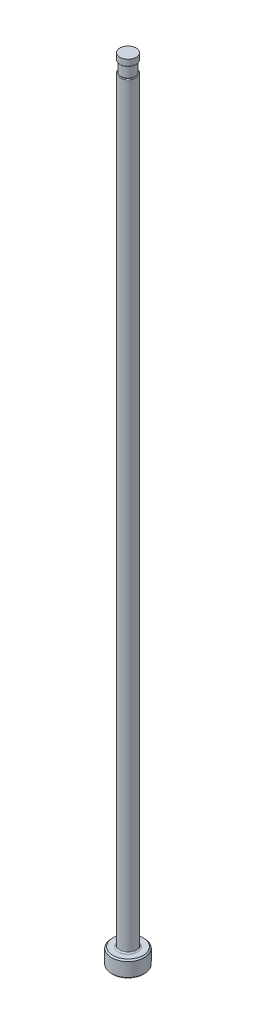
ISO-10303-21;
HEADER;
FILE_DESCRIPTION(('STEP AP214'),'2;1');
FILE_NAME('part.step','',(''),(''),'','','');
FILE_SCHEMA(('AUTOMOTIVE_DESIGN { 1 0 10303 214 1 1 1 1 }'));
ENDSEC;
DATA;
#1=APPLICATION_CONTEXT('core data for automotive mechanical design processes');
#2=APPLICATION_PROTOCOL_DEFINITION('international standard','automotive_design',2000,#1);
#3=PRODUCT_CONTEXT('',#1,'mechanical');
#4=PRODUCT('Part','Part','',(#3));
#5=PRODUCT_RELATED_PRODUCT_CATEGORY('part','',(#4));
#6=PRODUCT_DEFINITION_FORMATION('','',#4);
#7=PRODUCT_DEFINITION_CONTEXT('part definition',#1,'design');
#8=PRODUCT_DEFINITION('design','',#6,#7);
#9=PRODUCT_DEFINITION_SHAPE('','',#8);
#10=(LENGTH_UNIT() NAMED_UNIT(*) SI_UNIT(.MILLI.,.METRE.));
#11=(NAMED_UNIT(*) PLANE_ANGLE_UNIT() SI_UNIT($,.RADIAN.));
#12=(NAMED_UNIT(*) SI_UNIT($,.STERADIAN.) SOLID_ANGLE_UNIT());
#13=UNCERTAINTY_MEASURE_WITH_UNIT(LENGTH_MEASURE(1.E-05),#10,'distance_accuracy_value','');
#14=(GEOMETRIC_REPRESENTATION_CONTEXT(3) GLOBAL_UNCERTAINTY_ASSIGNED_CONTEXT((#13)) GLOBAL_UNIT_ASSIGNED_CONTEXT((#10,
#11,#12)) REPRESENTATION_CONTEXT('',''));
#15=CARTESIAN_POINT('',(0.,0.,0.));
#16=DIRECTION('',(0.,0.,1.));
#17=DIRECTION('',(1.,0.,0.));
#18=AXIS2_PLACEMENT_3D('',#15,#16,#17);
#19=CARTESIAN_POINT('',(-1.58749999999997,151.13,0.));
#20=DIRECTION('',(0.,1.,0.));
#21=DIRECTION('',(0.,0.,1.));
#22=AXIS2_PLACEMENT_3D('',#19,#20,#21);
#23=PLANE('',#22);
#24=CARTESIAN_POINT('',(0.,151.13,0.));
#25=DIRECTION('',(0.,1.,0.));
#26=DIRECTION('',(0.,0.,1.));
#27=AXIS2_PLACEMENT_3D('',#24,#25,#26);
#28=CIRCLE('',#27,1.44144999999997);
#29=CARTESIAN_POINT('',(0.,151.13,1.44144999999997));
#30=VERTEX_POINT('',#29);
#31=EDGE_CURVE('E11',#30,#30,#28,.F.);
#32=ORIENTED_EDGE('',*,*,#31,.T.);
#33=EDGE_LOOP('',(#32));
#34=FACE_BOUND('',#33,.T.);
#35=CARTESIAN_POINT('',(0.,151.13,0.));
#36=DIRECTION('',(0.,1.,0.));
#37=DIRECTION('',(0.,0.,1.));
#38=AXIS2_PLACEMENT_3D('',#35,#36,#37);
#39=CIRCLE('',#38,1.38429999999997);
#40=CARTESIAN_POINT('',(0.,151.13,1.38429999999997));
#41=VERTEX_POINT('',#40);
#42=EDGE_CURVE('E78',#41,#41,#39,.T.);
#43=ORIENTED_EDGE('',*,*,#42,.T.);
#44=EDGE_LOOP('',(#43));
#45=FACE_BOUND('',#44,.T.);
#46=ADVANCED_FACE('F36',(#34,#45),#23,.F.);
#47=CARTESIAN_POINT('',(0.,259.958771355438,0.));
#48=DIRECTION('',(0.,1.,0.));
#49=DIRECTION('',(0.,0.,1.));
#50=AXIS2_PLACEMENT_3D('',#47,#48,#49);
#51=CYLINDRICAL_SURFACE('',#50,1.58749999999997);
#52=DIRECTION('',(0.,1.,0.));
#53=VECTOR('',#52,1.);
#54=CARTESIAN_POINT('',(-1.38429999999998,259.958771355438,-0.777090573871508));
#55=LINE('',#54,#53);
#56=CARTESIAN_POINT('',(-1.38429999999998,148.971,-0.777090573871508));
#57=VERTEX_POINT('',#56);
#58=CARTESIAN_POINT('',(-1.38429999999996,86.614,-0.777090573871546));
#59=VERTEX_POINT('',#58);
#60=EDGE_CURVE('E73',#57,#59,#55,.F.);
#61=ORIENTED_EDGE('',*,*,#60,.F.);
#62=CARTESIAN_POINT('',(0.,148.971,0.));
#63=DIRECTION('',(0.,-1.,0.));
#64=DIRECTION('',(0.,0.,-1.));
#65=AXIS2_PLACEMENT_3D('',#62,#63,#64);
#66=CIRCLE('',#65,1.58749999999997);
#67=CARTESIAN_POINT('',(-1.38429999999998,148.971,0.777090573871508));
#68=VERTEX_POINT('',#67);
#69=EDGE_CURVE('E51',#57,#68,#66,.T.);
#70=ORIENTED_EDGE('',*,*,#69,.T.);
#71=DIRECTION('',(0.,1.,0.));
#72=VECTOR('',#71,1.);
#73=CARTESIAN_POINT('',(-1.38429999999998,259.958771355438,0.777090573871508));
#74=LINE('',#73,#72);
#75=CARTESIAN_POINT('',(-1.38429999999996,86.614,0.777090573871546));
#76=VERTEX_POINT('',#75);
#77=EDGE_CURVE('E84',#76,#68,#74,.T.);
#78=ORIENTED_EDGE('',*,*,#77,.F.);
#79=CARTESIAN_POINT('',(-1.38429999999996,86.614,-0.777090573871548));
#80=CARTESIAN_POINT('',(-1.38429609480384,86.5767272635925,-0.777082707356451));
#81=CARTESIAN_POINT('',(-1.38495631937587,86.5394527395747,-0.775921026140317));
#82=CARTESIAN_POINT('',(-1.38757712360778,86.4650763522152,-0.771232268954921));
#83=CARTESIAN_POINT('',(-1.38953849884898,86.4279746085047,-0.767703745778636));
#84=CARTESIAN_POINT('',(-1.39477495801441,86.3535790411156,-0.758148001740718));
#85=CARTESIAN_POINT('',(-1.39807044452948,86.316291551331,-0.752081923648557));
#86=CARTESIAN_POINT('',(-1.40590319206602,86.2423849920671,-0.737333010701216));
#87=CARTESIAN_POINT('',(-1.41044024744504,86.2057658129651,-0.728650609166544));
#88=CARTESIAN_POINT('',(-1.42582382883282,86.096986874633,-0.698367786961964));
#89=CARTESIAN_POINT('',(-1.43842338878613,86.0261687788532,-0.672562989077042));
#90=CARTESIAN_POINT('',(-1.46680838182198,85.8916572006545,-0.608160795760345));
#91=CARTESIAN_POINT('',(-1.48256997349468,85.8279156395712,-0.569657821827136));
#92=CARTESIAN_POINT('',(-1.50737283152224,85.7379333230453,-0.498685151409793));
#93=CARTESIAN_POINT('',(-1.51626333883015,85.7076802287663,-0.471232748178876));
#94=CARTESIAN_POINT('',(-1.53347485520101,85.6517865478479,-0.411785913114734));
#95=CARTESIAN_POINT('',(-1.54179640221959,85.6261415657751,-0.379795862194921));
#96=CARTESIAN_POINT('',(-1.55583338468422,85.5843277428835,-0.316871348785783));
#97=CARTESIAN_POINT('',(-1.56175286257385,85.5673042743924,-0.28655344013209));
#98=CARTESIAN_POINT('',(-1.57203785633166,85.53830135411,-0.223329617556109));
#99=CARTESIAN_POINT('',(-1.57640406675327,85.5263196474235,-0.190424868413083));
#100=CARTESIAN_POINT('',(-1.58312350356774,85.5080632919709,-0.122641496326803));
#101=CARTESIAN_POINT('',(-1.58546485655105,85.5018222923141,-0.0877524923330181));
#102=CARTESIAN_POINT('',(-1.58779523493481,85.4956097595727,-0.0173445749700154));
#103=CARTESIAN_POINT('',(-1.58778524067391,85.4956356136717,0.0181740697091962));
#104=CARTESIAN_POINT('',(-1.58553927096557,85.5016246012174,0.0850166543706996));
#105=CARTESIAN_POINT('',(-1.58352667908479,85.5069919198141,0.116403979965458));
#106=CARTESIAN_POINT('',(-1.57781194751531,85.5224774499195,0.177812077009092));
#107=CARTESIAN_POINT('',(-1.57410971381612,85.5325959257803,0.20783277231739));
#108=CARTESIAN_POINT('',(-1.56522233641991,85.5574483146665,0.266740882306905));
#109=CARTESIAN_POINT('',(-1.55999564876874,85.5723128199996,0.295566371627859));
#110=CARTESIAN_POINT('',(-1.54854541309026,85.6058843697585,0.350651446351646));
#111=CARTESIAN_POINT('',(-1.54232137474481,85.6245933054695,0.376909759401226));
#112=CARTESIAN_POINT('',(-1.52624085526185,85.674770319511,0.438380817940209));
#113=CARTESIAN_POINT('',(-1.51605337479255,85.7080994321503,0.471992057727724));
#114=CARTESIAN_POINT('',(-1.49561074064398,85.7798332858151,0.533246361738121));
#115=CARTESIAN_POINT('',(-1.48535548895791,85.8182487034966,0.560876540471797));
#116=CARTESIAN_POINT('',(-1.46194815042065,85.9138127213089,0.61985698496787));
#117=CARTESIAN_POINT('',(-1.44915247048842,85.9725828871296,0.648714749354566));
#118=CARTESIAN_POINT('',(-1.42648713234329,86.0944065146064,0.697138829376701));
#119=CARTESIAN_POINT('',(-1.41662511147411,86.1574706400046,0.716680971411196));
#120=CARTESIAN_POINT('',(-1.40064446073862,86.2858415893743,0.747428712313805));
#121=CARTESIAN_POINT('',(-1.39451475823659,86.3511411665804,0.758658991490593));
#122=CARTESIAN_POINT('',(-1.38838804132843,86.449622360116,0.769772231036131));
#123=CARTESIAN_POINT('',(-1.38685717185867,86.4824222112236,0.772521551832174));
#124=CARTESIAN_POINT('',(-1.38481284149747,86.5481449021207,0.776178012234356));
#125=CARTESIAN_POINT('',(-1.38429902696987,86.5810676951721,0.777085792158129));
#126=CARTESIAN_POINT('',(-1.38429999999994,86.6139999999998,0.777090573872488));
#127=B_SPLINE_CURVE_WITH_KNOTS('',3,(#79,#80,#81,#82,#83,#84,#85,#86,#87,#88,#89,#90,#91,#92,
#93,#94,#95,#96,#97,#98,#99,#100,#101,#102,#103,#104,#105,#106,#107,#108,#109,#110,#111,#112,
#113,#114,#115,#116,#117,#118,#119,#120,#121,#122,#123,#124,#125,#126),.UNSPECIFIED.,.F.,.F.,(4,
2,2,2,2,2,2,2,2,2,2,2,2,2,2,2,2,2,2,2,2,2,2,4),(0.,0.111796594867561,0.22366161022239,
0.33730621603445,0.450932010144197,0.678971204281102,0.905351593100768,1.03037322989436,
1.1552749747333,1.26065408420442,1.36598601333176,1.47193148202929,1.57783277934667,
1.67311136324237,1.76839524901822,1.86656705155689,1.96478726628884,2.10923104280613,
2.25398297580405,2.45303424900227,2.65259927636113,2.85156933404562,2.95036438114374,
3.04912507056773),.UNSPECIFIED.);
#128=EDGE_CURVE('E81',#59,#76,#127,.T.);
#129=ORIENTED_EDGE('',*,*,#128,.F.);
#130=EDGE_LOOP('',(#61,#70,#78,#129));
#131=FACE_BOUND('',#130,.T.);
#132=CARTESIAN_POINT('',(0.,3.42900000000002,0.));
#133=DIRECTION('',(0.,1.,0.));
#134=DIRECTION('',(0.,0.,1.));
#135=AXIS2_PLACEMENT_3D('',#132,#133,#134);
#136=CIRCLE('',#135,1.58749999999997);
#137=CARTESIAN_POINT('',(0.,3.42900000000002,1.58749999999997));
#138=VERTEX_POINT('',#137);
#139=EDGE_CURVE('E116',#138,#138,#136,.T.);
#140=ORIENTED_EDGE('',*,*,#139,.T.);
#141=EDGE_LOOP('',(#140));
#142=FACE_BOUND('',#141,.T.);
#143=ADVANCED_FACE('F82',(#131,#142),#51,.T.);
#144=CARTESIAN_POINT('',(0.,0.,0.));
#145=DIRECTION('',(0.,-1.,0.));
#146=DIRECTION('',(0.,0.,-1.));
#147=AXIS2_PLACEMENT_3D('',#144,#145,#146);
#148=PLANE('',#147);
#149=CARTESIAN_POINT('',(0.,0.,0.));
#150=DIRECTION('',(0.,-1.,0.));
#151=DIRECTION('',(0.,0.,-1.));
#152=AXIS2_PLACEMENT_3D('',#149,#150,#151);
#153=CIRCLE('',#152,2.92099999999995);
#154=CARTESIAN_POINT('',(0.,0.,-2.92099999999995));
#155=VERTEX_POINT('',#154);
#156=EDGE_CURVE('E113',#155,#155,#153,.T.);
#157=ORIENTED_EDGE('',*,*,#156,.T.);
#158=EDGE_LOOP('',(#157));
#159=FACE_BOUND('',#158,.T.);
#160=ADVANCED_FACE('F192',(#159),#148,.T.);
#161=CARTESIAN_POINT('',(0.,259.958771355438,0.));
#162=DIRECTION('',(0.,1.,0.));
#163=DIRECTION('',(0.,0.,1.));
#164=AXIS2_PLACEMENT_3D('',#161,#162,#163);
#165=CYLINDRICAL_SURFACE('',#164,3.17499999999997);
#166=CARTESIAN_POINT('',(0.,2.92100000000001,0.));
#167=DIRECTION('',(0.,1.,0.));
#168=DIRECTION('',(0.,0.,1.));
#169=AXIS2_PLACEMENT_3D('',#166,#167,#168);
#170=CIRCLE('',#169,3.17499999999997);
#171=CARTESIAN_POINT('',(0.,2.92100000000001,3.17499999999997));
#172=VERTEX_POINT('',#171);
#173=EDGE_CURVE('E110',#172,#172,#170,.F.);
#174=ORIENTED_EDGE('',*,*,#173,.T.);
#175=EDGE_LOOP('',(#174));
#176=FACE_BOUND('',#175,.T.);
#177=CARTESIAN_POINT('',(0.,0.254000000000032,0.));
#178=DIRECTION('',(0.,-1.,0.));
#179=DIRECTION('',(0.,0.,-1.));
#180=AXIS2_PLACEMENT_3D('',#177,#178,#179);
#181=CIRCLE('',#180,3.17499999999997);
#182=CARTESIAN_POINT('',(0.,0.254000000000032,-3.17499999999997));
#183=VERTEX_POINT('',#182);
#184=EDGE_CURVE('E107',#183,#183,#181,.F.);
#185=ORIENTED_EDGE('',*,*,#184,.T.);
#186=EDGE_LOOP('',(#185));
#187=FACE_BOUND('',#186,.T.);
#188=ADVANCED_FACE('F195',(#176,#187),#165,.T.);
#189=CARTESIAN_POINT('',(-3.17499999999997,3.175,0.));
#190=DIRECTION('',(0.,1.,0.));
#191=DIRECTION('',(0.,0.,1.));
#192=AXIS2_PLACEMENT_3D('',#189,#190,#191);
#193=PLANE('',#192);
#194=CARTESIAN_POINT('',(0.,3.175,0.));
#195=DIRECTION('',(0.,1.,0.));
#196=DIRECTION('',(0.,0.,1.));
#197=AXIS2_PLACEMENT_3D('',#194,#195,#196);
#198=CIRCLE('',#197,1.84149999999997);
#199=CARTESIAN_POINT('',(0.,3.175,1.84149999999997));
#200=VERTEX_POINT('',#199);
#201=EDGE_CURVE('E87',#200,#200,#198,.F.);
#202=ORIENTED_EDGE('',*,*,#201,.T.);
#203=EDGE_LOOP('',(#202));
#204=FACE_BOUND('',#203,.T.);
#205=CARTESIAN_POINT('',(0.,3.175,0.));
#206=DIRECTION('',(0.,1.,0.));
#207=DIRECTION('',(0.,0.,1.));
#208=AXIS2_PLACEMENT_3D('',#205,#206,#207);
#209=CIRCLE('',#208,2.92099999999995);
#210=CARTESIAN_POINT('',(0.,3.175,2.92099999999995));
#211=VERTEX_POINT('',#210);
#212=EDGE_CURVE('E104',#211,#211,#209,.T.);
#213=ORIENTED_EDGE('',*,*,#212,.T.);
#214=EDGE_LOOP('',(#213));
#215=FACE_BOUND('',#214,.T.);
#216=ADVANCED_FACE('F190',(#204,#215),#193,.T.);
#217=CARTESIAN_POINT('',(0.,3.17499999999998,0.));
#218=DIRECTION('',(0.,-1.,0.));
#219=DIRECTION('',(0.,0.,-1.));
#220=AXIS2_PLACEMENT_3D('',#217,#218,#219);
#221=CONICAL_SURFACE('',#220,2.92099999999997,0.7853981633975);
#222=ORIENTED_EDGE('',*,*,#173,.F.);
#223=EDGE_LOOP('',(#222));
#224=FACE_BOUND('',#223,.T.);
#225=ORIENTED_EDGE('',*,*,#212,.F.);
#226=EDGE_LOOP('',(#225));
#227=FACE_BOUND('',#226,.T.);
#228=ADVANCED_FACE('F186',(#224,#227),#221,.T.);
#229=CARTESIAN_POINT('',(0.,0.254000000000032,0.));
#230=DIRECTION('',(0.,1.,0.));
#231=DIRECTION('',(0.,0.,1.));
#232=AXIS2_PLACEMENT_3D('',#229,#230,#231);
#233=CONICAL_SURFACE('',#232,3.17499999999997,0.785398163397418);
#234=ORIENTED_EDGE('',*,*,#156,.F.);
#235=EDGE_LOOP('',(#234));
#236=FACE_BOUND('',#235,.T.);
#237=ORIENTED_EDGE('',*,*,#184,.F.);
#238=EDGE_LOOP('',(#237));
#239=FACE_BOUND('',#238,.T.);
#240=ADVANCED_FACE('F182',(#236,#239),#233,.T.);
#241=CARTESIAN_POINT('',(0.,3.42900000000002,0.));
#242=DIRECTION('',(0.,1.,0.));
#243=DIRECTION('',(0.,0.,1.));
#244=AXIS2_PLACEMENT_3D('',#241,#242,#243);
#245=TOROIDAL_SURFACE('',#244,1.84149999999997,0.254);
#246=ORIENTED_EDGE('',*,*,#201,.F.);
#247=EDGE_LOOP('',(#246));
#248=FACE_BOUND('',#247,.T.);
#249=ORIENTED_EDGE('',*,*,#139,.F.);
#250=EDGE_LOOP('',(#249));
#251=FACE_BOUND('',#250,.T.);
#252=ADVANCED_FACE('F147',(#248,#251),#245,.F.);
#253=CARTESIAN_POINT('',(-1.58749999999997,149.098,0.));
#254=DIRECTION('',(0.,-1.,0.));
#255=DIRECTION('',(0.,0.,-1.));
#256=AXIS2_PLACEMENT_3D('',#253,#254,#255);
#257=PLANE('',#256);
#258=DIRECTION('',(0.,0.,1.));
#259=VECTOR('',#258,1.);
#260=CARTESIAN_POINT('',(-1.38429999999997,149.098,0.));
#261=LINE('',#260,#259);
#262=CARTESIAN_POINT('',(-1.38429999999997,149.098,0.));
#263=VERTEX_POINT('',#262);
#264=CARTESIAN_POINT('',(-1.38429999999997,149.098,0.465589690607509));
#265=VERTEX_POINT('',#264);
#266=EDGE_CURVE('E90',#263,#265,#261,.T.);
#267=ORIENTED_EDGE('',*,*,#266,.T.);
#268=CARTESIAN_POINT('',(0.,149.098,0.));
#269=DIRECTION('',(0.,-1.,0.));
#270=DIRECTION('',(0.,0.,-1.));
#271=AXIS2_PLACEMENT_3D('',#268,#269,#270);
#272=CIRCLE('',#271,1.46049999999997);
#273=CARTESIAN_POINT('',(-1.38429999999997,149.098,-0.465589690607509));
#274=VERTEX_POINT('',#273);
#275=EDGE_CURVE('E86',#265,#274,#272,.F.);
#276=ORIENTED_EDGE('',*,*,#275,.T.);
#277=EDGE_CURVE('E79',#274,#263,#261,.T.);
#278=ORIENTED_EDGE('',*,*,#277,.T.);
#279=CARTESIAN_POINT('',(0.,149.098,0.));
#280=DIRECTION('',(0.,1.,0.));
#281=DIRECTION('',(0.,0.,1.));
#282=AXIS2_PLACEMENT_3D('',#279,#280,#281);
#283=CIRCLE('',#282,1.38429999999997);
#284=EDGE_CURVE('E101',#263,#263,#283,.T.);
#285=ORIENTED_EDGE('',*,*,#284,.F.);
#286=EDGE_LOOP('',(#267,#276,#278,#285));
#287=FACE_BOUND('',#286,.T.);
#288=ADVANCED_FACE('F144',(#287),#257,.F.);
#289=CARTESIAN_POINT('',(0.,153.448281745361,0.));
#290=DIRECTION('',(0.,1.,0.));
#291=DIRECTION('',(0.,0.,1.));
#292=AXIS2_PLACEMENT_3D('',#289,#290,#291);
#293=CYLINDRICAL_SURFACE('',#292,1.38429999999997);
#294=ORIENTED_EDGE('',*,*,#42,.F.);
#295=EDGE_LOOP('',(#294));
#296=FACE_BOUND('',#295,.T.);
#297=ORIENTED_EDGE('',*,*,#284,.T.);
#298=EDGE_LOOP('',(#297));
#299=FACE_BOUND('',#298,.T.);
#300=ADVANCED_FACE('F141',(#296,#299),#293,.T.);
#301=CARTESIAN_POINT('',(-1.38429999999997,150.114,-3.17499999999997));
#302=DIRECTION('',(1.,0.,0.));
#303=DIRECTION('',(0.,1.,0.));
#304=AXIS2_PLACEMENT_3D('',#301,#302,#303);
#305=PLANE('',#304);
#306=ORIENTED_EDGE('',*,*,#277,.F.);
#307=CARTESIAN_POINT('',(-1.38429999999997,149.098,-0.465589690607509));
#308=CARTESIAN_POINT('',(-1.38429999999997,149.097994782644,-0.479559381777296));
#309=CARTESIAN_POINT('',(-1.38429999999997,149.097765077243,-0.493535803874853));
#310=CARTESIAN_POINT('',(-1.38429999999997,149.096708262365,-0.521508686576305));
#311=CARTESIAN_POINT('',(-1.38429999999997,149.095879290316,-0.535505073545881));
#312=CARTESIAN_POINT('',(-1.38429999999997,149.093476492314,-0.563404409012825));
#313=CARTESIAN_POINT('',(-1.38429999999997,149.091904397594,-0.577307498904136));
#314=CARTESIAN_POINT('',(-1.38429999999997,149.087817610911,-0.604962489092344));
#315=CARTESIAN_POINT('',(-1.38429999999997,149.085304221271,-0.618714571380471));
#316=CARTESIAN_POINT('',(-1.38429999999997,149.080078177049,-0.641494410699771));
#317=CARTESIAN_POINT('',(-1.38429999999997,149.077698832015,-0.650597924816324));
#318=CARTESIAN_POINT('',(-1.38429999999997,149.072254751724,-0.668645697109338));
#319=CARTESIAN_POINT('',(-1.38429999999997,149.069187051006,-0.677589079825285));
#320=CARTESIAN_POINT('',(-1.38429999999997,149.061185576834,-0.697758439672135));
#321=CARTESIAN_POINT('',(-1.38429999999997,149.055968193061,-0.708874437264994));
#322=CARTESIAN_POINT('',(-1.38429999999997,149.04365165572,-0.730002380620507));
#323=CARTESIAN_POINT('',(-1.38429999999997,149.036567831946,-0.740022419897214));
#324=CARTESIAN_POINT('',(-1.38429999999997,149.02508447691,-0.752196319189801));
#325=CARTESIAN_POINT('',(-1.38429999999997,149.021763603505,-0.75536058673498));
#326=CARTESIAN_POINT('',(-1.38429999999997,149.014727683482,-0.761230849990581));
#327=CARTESIAN_POINT('',(-1.38429999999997,149.011012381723,-0.763936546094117));
#328=CARTESIAN_POINT('',(-1.38429999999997,149.003139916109,-0.768755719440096));
#329=CARTESIAN_POINT('',(-1.38429999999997,148.998977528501,-0.770860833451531));
#330=CARTESIAN_POINT('',(-1.38429999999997,148.990327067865,-0.774221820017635));
#331=CARTESIAN_POINT('',(-1.38429999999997,148.985840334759,-0.775480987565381));
#332=CARTESIAN_POINT('',(-1.38429999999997,148.97957988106,-0.77652141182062));
#333=CARTESIAN_POINT('',(-1.38429999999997,148.977871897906,-0.776734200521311));
#334=CARTESIAN_POINT('',(-1.38429999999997,148.974442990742,-0.777018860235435));
#335=CARTESIAN_POINT('',(-1.38429999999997,148.972722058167,-0.77709062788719));
#336=CARTESIAN_POINT('',(-1.38429999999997,148.971,-0.777090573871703));
#337=B_SPLINE_CURVE_WITH_KNOTS('',3,(#307,#308,#309,#310,#311,#312,#313,#314,#315,#316,#317,
#318,#319,#320,#321,#322,#323,#324,#325,#326,#327,#328,#329,#330,#331,#332,#333,#334,#335,#336),
.UNSPECIFIED.,.F.,.F.,(4,2,2,2,2,2,2,2,2,2,2,2,2,2,4),(0.,0.0419176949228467,0.0839662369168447,
0.125917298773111,0.167810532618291,0.196018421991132,0.224350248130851,0.261087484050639,
0.29753191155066,0.311262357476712,0.325001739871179,0.338924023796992,0.352791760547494,
0.357950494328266,0.363113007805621),.UNSPECIFIED.);
#338=EDGE_CURVE('E59',#274,#57,#337,.T.);
#339=ORIENTED_EDGE('',*,*,#338,.T.);
#340=ORIENTED_EDGE('',*,*,#60,.T.);
#341=DIRECTION('',(0.,0.,1.));
#342=VECTOR('',#341,1.);
#343=CARTESIAN_POINT('',(-1.38429999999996,86.614,-3.17499999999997));
#344=LINE('',#343,#342);
#345=EDGE_CURVE('E77',#59,#76,#344,.T.);
#346=ORIENTED_EDGE('',*,*,#345,.T.);
#347=ORIENTED_EDGE('',*,*,#77,.T.);
#348=CARTESIAN_POINT('',(-1.38429999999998,148.971,0.777090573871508));
#349=CARTESIAN_POINT('',(-1.38429999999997,148.974750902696,0.777099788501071));
#350=CARTESIAN_POINT('',(-1.38429999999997,148.9784915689,0.776751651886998));
#351=CARTESIAN_POINT('',(-1.38429999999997,148.985825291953,0.775421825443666));
#352=CARTESIAN_POINT('',(-1.38429999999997,148.989419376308,0.774445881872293));
#353=CARTESIAN_POINT('',(-1.38429999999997,148.996393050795,0.771942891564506));
#354=CARTESIAN_POINT('',(-1.38429999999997,148.999773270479,0.770417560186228));
#355=CARTESIAN_POINT('',(-1.38429999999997,149.006296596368,0.766915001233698));
#356=CARTESIAN_POINT('',(-1.38429999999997,149.00943911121,0.764936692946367));
#357=CARTESIAN_POINT('',(-1.38429999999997,149.017606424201,0.759093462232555));
#358=CARTESIAN_POINT('',(-1.38429999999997,149.022385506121,0.754885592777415));
#359=CARTESIAN_POINT('',(-1.38429999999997,149.031244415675,0.745791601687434));
#360=CARTESIAN_POINT('',(-1.38429999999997,149.035322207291,0.740903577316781));
#361=CARTESIAN_POINT('',(-1.38429999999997,149.045805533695,0.726719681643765));
#362=CARTESIAN_POINT('',(-1.38429999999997,149.051560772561,0.71694762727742));
#363=CARTESIAN_POINT('',(-1.38429999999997,149.061646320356,0.696707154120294));
#364=CARTESIAN_POINT('',(-1.38429999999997,149.065972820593,0.686236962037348));
#365=CARTESIAN_POINT('',(-1.38429999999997,149.074704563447,0.661619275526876));
#366=CARTESIAN_POINT('',(-1.38429999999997,149.078720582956,0.647335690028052));
#367=CARTESIAN_POINT('',(-1.38429999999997,149.085382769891,0.618445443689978));
#368=CARTESIAN_POINT('',(-1.38429999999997,149.08802632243,0.603838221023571));
#369=CARTESIAN_POINT('',(-1.38429999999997,149.094406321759,0.559733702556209));
#370=CARTESIAN_POINT('',(-1.38429999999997,149.096575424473,0.530010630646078));
#371=CARTESIAN_POINT('',(-1.38429999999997,149.097661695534,0.494502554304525));
#372=CARTESIAN_POINT('',(-1.38429999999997,149.097791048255,0.488707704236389));
#373=CARTESIAN_POINT('',(-1.38429999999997,149.097960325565,0.477139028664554));
#374=CARTESIAN_POINT('',(-1.38429999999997,149.098000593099,0.471365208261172));
#375=CARTESIAN_POINT('',(-1.38429999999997,149.098,0.465589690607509));
#376=B_SPLINE_CURVE_WITH_KNOTS('',3,(#348,#349,#350,#351,#352,#353,#354,#355,#356,#357,#358,
#359,#360,#361,#362,#363,#364,#365,#366,#367,#368,#369,#370,#371,#372,#373,#374,#375),
.UNSPECIFIED.,.F.,.F.,(4,2,2,2,2,2,2,2,2,2,2,2,2,4),(0.,0.0112203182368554,0.0223393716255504,
0.0334240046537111,0.0445353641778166,0.0635271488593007,0.0825731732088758,0.116404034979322,
0.150324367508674,0.194732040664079,0.239224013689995,0.328384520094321,0.345774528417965,
0.36309747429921),.UNSPECIFIED.);
#377=EDGE_CURVE('E172',#68,#265,#376,.T.);
#378=ORIENTED_EDGE('',*,*,#377,.T.);
#379=ORIENTED_EDGE('',*,*,#266,.F.);
#380=EDGE_LOOP('',(#306,#339,#340,#346,#347,#378,#379));
#381=FACE_BOUND('',#380,.T.);
#382=ADVANCED_FACE('F75',(#381),#305,.F.);
#383=CARTESIAN_POINT('',(-4.55929999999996,86.614,-3.17499999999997));
#384=DIRECTION('',(0.,0.,1.));
#385=DIRECTION('',(1.,0.,0.));
#386=AXIS2_PLACEMENT_3D('',#383,#384,#385);
#387=CYLINDRICAL_SURFACE('',#386,3.175);
#388=ORIENTED_EDGE('',*,*,#345,.F.);
#389=ORIENTED_EDGE('',*,*,#128,.T.);
#390=EDGE_LOOP('',(#388,#389));
#391=FACE_BOUND('',#390,.T.);
#392=ADVANCED_FACE('F89',(#391),#387,.F.);
#393=CARTESIAN_POINT('',(0.,152.687735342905,0.));
#394=DIRECTION('',(0.,1.,0.));
#395=DIRECTION('',(0.,0.,1.));
#396=AXIS2_PLACEMENT_3D('',#393,#394,#395);
#397=CYLINDRICAL_SURFACE('',#396,1.56844999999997);
#398=CARTESIAN_POINT('',(0.,151.257,0.));
#399=DIRECTION('',(0.,1.,0.));
#400=DIRECTION('',(0.,0.,1.));
#401=AXIS2_PLACEMENT_3D('',#398,#399,#400);
#402=CIRCLE('',#401,1.56844999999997);
#403=CARTESIAN_POINT('',(0.,151.257,1.56844999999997));
#404=VERTEX_POINT('',#403);
#405=EDGE_CURVE('E44',#404,#404,#402,.T.);
#406=ORIENTED_EDGE('',*,*,#405,.T.);
#407=EDGE_LOOP('',(#406));
#408=FACE_BOUND('',#407,.T.);
#409=CARTESIAN_POINT('',(0.,152.4,0.));
#410=DIRECTION('',(0.,1.,0.));
#411=DIRECTION('',(0.,0.,1.));
#412=AXIS2_PLACEMENT_3D('',#409,#410,#411);
#413=CIRCLE('',#412,1.56844999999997);
#414=CARTESIAN_POINT('',(0.,152.4,1.56844999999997));
#415=VERTEX_POINT('',#414);
#416=EDGE_CURVE('E91',#415,#415,#413,.T.);
#417=ORIENTED_EDGE('',*,*,#416,.F.);
#418=EDGE_LOOP('',(#417));
#419=FACE_BOUND('',#418,.T.);
#420=ADVANCED_FACE('F135',(#408,#419),#397,.T.);
#421=CARTESIAN_POINT('',(-1.58749999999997,152.4,0.));
#422=DIRECTION('',(0.,1.,0.));
#423=DIRECTION('',(0.,0.,1.));
#424=AXIS2_PLACEMENT_3D('',#421,#422,#423);
#425=PLANE('',#424);
#426=ORIENTED_EDGE('',*,*,#416,.T.);
#427=EDGE_LOOP('',(#426));
#428=FACE_BOUND('',#427,.T.);
#429=ADVANCED_FACE('F149',(#428),#425,.T.);
#430=CARTESIAN_POINT('',(0.,148.971,0.));
#431=DIRECTION('',(0.,-1.,0.));
#432=DIRECTION('',(0.,0.,-1.));
#433=AXIS2_PLACEMENT_3D('',#430,#431,#432);
#434=TOROIDAL_SURFACE('',#433,1.46049999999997,0.127);
#435=ORIENTED_EDGE('',*,*,#377,.F.);
#436=ORIENTED_EDGE('',*,*,#69,.F.);
#437=ORIENTED_EDGE('',*,*,#338,.F.);
#438=ORIENTED_EDGE('',*,*,#275,.F.);
#439=EDGE_LOOP('',(#435,#436,#437,#438));
#440=FACE_BOUND('',#439,.T.);
#441=ADVANCED_FACE('F151',(#440),#434,.T.);
#442=CARTESIAN_POINT('',(0.,151.257,0.));
#443=DIRECTION('',(0.,1.,0.));
#444=DIRECTION('',(0.,0.,1.));
#445=AXIS2_PLACEMENT_3D('',#442,#443,#444);
#446=TOROIDAL_SURFACE('',#445,1.44144999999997,0.127);
#447=ORIENTED_EDGE('',*,*,#31,.F.);
#448=EDGE_LOOP('',(#447));
#449=FACE_BOUND('',#448,.T.);
#450=ORIENTED_EDGE('',*,*,#405,.F.);
#451=EDGE_LOOP('',(#450));
#452=FACE_BOUND('',#451,.T.);
#453=ADVANCED_FACE('F38',(#449,#452),#446,.T.);
#454=CLOSED_SHELL('',(#46,#143,#160,#188,#216,#228,#240,#252,#288,#300,#382,#392,#420,#429,#441,#453));
#455=MANIFOLD_SOLID_BREP('B2',#454);
#456=ADVANCED_BREP_SHAPE_REPRESENTATION('',(#18,#455),#14);
#457=SHAPE_DEFINITION_REPRESENTATION(#9,#456);
ENDSEC;
END-ISO-10303-21;
